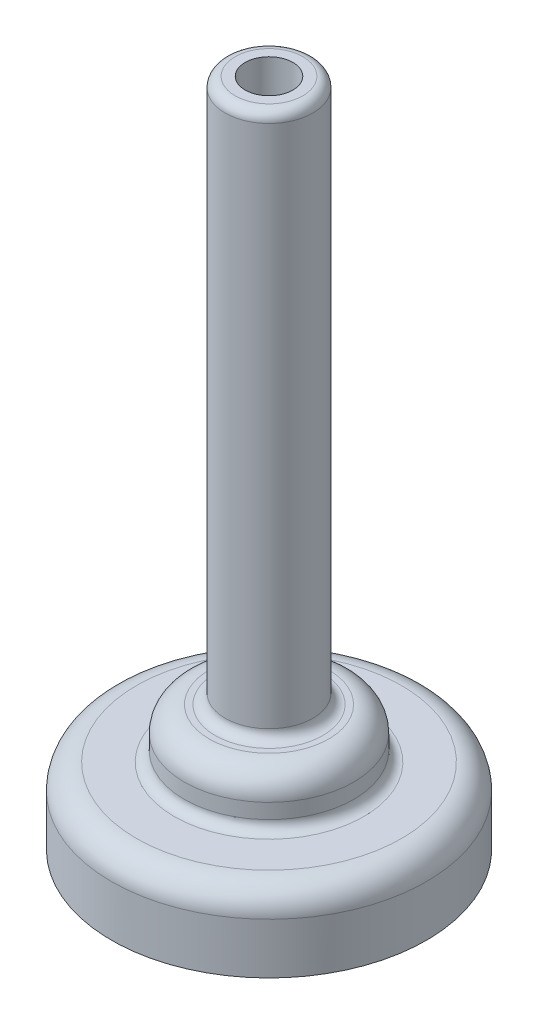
ISO-10303-21;
HEADER;
FILE_DESCRIPTION(('STEP AP214'),'2;1');
FILE_NAME('part.step','',(''),(''),'','','');
FILE_SCHEMA(('AUTOMOTIVE_DESIGN { 1 0 10303 214 1 1 1 1 }'));
ENDSEC;
DATA;
#1=APPLICATION_CONTEXT('core data for automotive mechanical design processes');
#2=APPLICATION_PROTOCOL_DEFINITION('international standard','automotive_design',2000,#1);
#3=PRODUCT_CONTEXT('',#1,'mechanical');
#4=PRODUCT('Part','Part','',(#3));
#5=PRODUCT_RELATED_PRODUCT_CATEGORY('part','',(#4));
#6=PRODUCT_DEFINITION_FORMATION('','',#4);
#7=PRODUCT_DEFINITION_CONTEXT('part definition',#1,'design');
#8=PRODUCT_DEFINITION('design','',#6,#7);
#9=PRODUCT_DEFINITION_SHAPE('','',#8);
#10=(LENGTH_UNIT() NAMED_UNIT(*) SI_UNIT(.MILLI.,.METRE.));
#11=(NAMED_UNIT(*) PLANE_ANGLE_UNIT() SI_UNIT($,.RADIAN.));
#12=(NAMED_UNIT(*) SI_UNIT($,.STERADIAN.) SOLID_ANGLE_UNIT());
#13=UNCERTAINTY_MEASURE_WITH_UNIT(LENGTH_MEASURE(1.E-05),#10,'distance_accuracy_value','');
#14=(GEOMETRIC_REPRESENTATION_CONTEXT(3) GLOBAL_UNCERTAINTY_ASSIGNED_CONTEXT((#13)) GLOBAL_UNIT_ASSIGNED_CONTEXT((#10,
#11,#12)) REPRESENTATION_CONTEXT('',''));
#15=CARTESIAN_POINT('',(0.,0.,0.));
#16=DIRECTION('',(0.,0.,1.));
#17=DIRECTION('',(1.,0.,0.));
#18=AXIS2_PLACEMENT_3D('',#15,#16,#17);
#19=CARTESIAN_POINT('',(-10.033,3.556,0.));
#20=DIRECTION('',(0.,1.,0.));
#21=DIRECTION('',(0.,0.,1.));
#22=AXIS2_PLACEMENT_3D('',#19,#20,#21);
#23=PLANE('',#22);
#24=CARTESIAN_POINT('',(0.,3.556,0.));
#25=DIRECTION('',(0.,1.,0.));
#26=DIRECTION('',(0.,0.,1.));
#27=AXIS2_PLACEMENT_3D('',#24,#25,#26);
#28=CIRCLE('',#27,4.7625);
#29=CARTESIAN_POINT('',(0.,3.556,4.7625));
#30=VERTEX_POINT('',#29);
#31=EDGE_CURVE('E42',#30,#30,#28,.T.);
#32=ORIENTED_EDGE('',*,*,#31,.T.);
#33=EDGE_LOOP('',(#32));
#34=FACE_BOUND('',#33,.T.);
#35=CARTESIAN_POINT('',(0.,3.556,0.));
#36=DIRECTION('',(0.,1.,0.));
#37=DIRECTION('',(0.,0.,1.));
#38=AXIS2_PLACEMENT_3D('',#35,#36,#37);
#39=CIRCLE('',#38,7.62);
#40=CARTESIAN_POINT('',(0.,3.556,7.62));
#41=VERTEX_POINT('',#40);
#42=EDGE_CURVE('E46',#41,#41,#39,.F.);
#43=ORIENTED_EDGE('',*,*,#42,.T.);
#44=EDGE_LOOP('',(#43));
#45=FACE_BOUND('',#44,.T.);
#46=ADVANCED_FACE('F31',(#34,#45),#23,.F.);
#47=CARTESIAN_POINT('',(-2.794,42.672,0.));
#48=DIRECTION('',(0.,1.,0.));
#49=DIRECTION('',(0.,0.,1.));
#50=AXIS2_PLACEMENT_3D('',#47,#48,#49);
#51=PLANE('',#50);
#52=CARTESIAN_POINT('',(0.,42.672,0.));
#53=DIRECTION('',(0.,1.,0.));
#54=DIRECTION('',(0.,0.,1.));
#55=AXIS2_PLACEMENT_3D('',#52,#53,#54);
#56=CIRCLE('',#55,2.159);
#57=CARTESIAN_POINT('',(0.,42.672,2.159));
#58=VERTEX_POINT('',#57);
#59=EDGE_CURVE('E10',#58,#58,#56,.T.);
#60=ORIENTED_EDGE('',*,*,#59,.T.);
#61=EDGE_LOOP('',(#60));
#62=FACE_BOUND('',#61,.T.);
#63=CARTESIAN_POINT('',(0.,42.672,0.));
#64=DIRECTION('',(0.,1.,0.));
#65=DIRECTION('',(0.,0.,1.));
#66=AXIS2_PLACEMENT_3D('',#63,#64,#65);
#67=CIRCLE('',#66,1.524);
#68=CARTESIAN_POINT('',(0.,42.672,1.524));
#69=VERTEX_POINT('',#68);
#70=EDGE_CURVE('E91',#69,#69,#67,.F.);
#71=ORIENTED_EDGE('',*,*,#70,.T.);
#72=EDGE_LOOP('',(#71));
#73=FACE_BOUND('',#72,.T.);
#74=ADVANCED_FACE('F123',(#62,#73),#51,.T.);
#75=CARTESIAN_POINT('',(0.,0.,0.));
#76=DIRECTION('',(0.,-1.,0.));
#77=DIRECTION('',(0.,0.,-1.));
#78=AXIS2_PLACEMENT_3D('',#75,#76,#77);
#79=CYLINDRICAL_SURFACE('',#78,2.794);
#80=CARTESIAN_POINT('',(0.,8.636,0.));
#81=DIRECTION('',(0.,1.,0.));
#82=DIRECTION('',(0.,0.,1.));
#83=AXIS2_PLACEMENT_3D('',#80,#81,#82);
#84=CIRCLE('',#83,2.794);
#85=CARTESIAN_POINT('',(0.,8.636,2.794));
#86=VERTEX_POINT('',#85);
#87=EDGE_CURVE('E66',#86,#86,#84,.T.);
#88=ORIENTED_EDGE('',*,*,#87,.T.);
#89=EDGE_LOOP('',(#88));
#90=FACE_BOUND('',#89,.T.);
#91=CARTESIAN_POINT('',(0.,42.037,0.));
#92=DIRECTION('',(0.,1.,0.));
#93=DIRECTION('',(0.,0.,1.));
#94=AXIS2_PLACEMENT_3D('',#91,#92,#93);
#95=CIRCLE('',#94,2.794);
#96=CARTESIAN_POINT('',(0.,42.037,2.794));
#97=VERTEX_POINT('',#96);
#98=EDGE_CURVE('E69',#97,#97,#95,.F.);
#99=ORIENTED_EDGE('',*,*,#98,.T.);
#100=EDGE_LOOP('',(#99));
#101=FACE_BOUND('',#100,.T.);
#102=ADVANCED_FACE('F129',(#90,#101),#79,.T.);
#103=CARTESIAN_POINT('',(-5.3975,8.001,0.));
#104=DIRECTION('',(0.,1.,0.));
#105=DIRECTION('',(0.,0.,1.));
#106=AXIS2_PLACEMENT_3D('',#103,#104,#105);
#107=PLANE('',#106);
#108=CARTESIAN_POINT('',(0.,8.001,0.));
#109=DIRECTION('',(0.,1.,0.));
#110=DIRECTION('',(0.,0.,1.));
#111=AXIS2_PLACEMENT_3D('',#108,#109,#110);
#112=CIRCLE('',#111,3.429);
#113=CARTESIAN_POINT('',(0.,8.001,3.429));
#114=VERTEX_POINT('',#113);
#115=EDGE_CURVE('E72',#114,#114,#112,.F.);
#116=ORIENTED_EDGE('',*,*,#115,.T.);
#117=EDGE_LOOP('',(#116));
#118=FACE_BOUND('',#117,.T.);
#119=CARTESIAN_POINT('',(0.,8.001,0.));
#120=DIRECTION('',(0.,1.,0.));
#121=DIRECTION('',(0.,0.,1.));
#122=AXIS2_PLACEMENT_3D('',#119,#120,#121);
#123=CIRCLE('',#122,3.81);
#124=CARTESIAN_POINT('',(0.,8.001,3.81));
#125=VERTEX_POINT('',#124);
#126=EDGE_CURVE('E75',#125,#125,#123,.T.);
#127=ORIENTED_EDGE('',*,*,#126,.T.);
#128=EDGE_LOOP('',(#127));
#129=FACE_BOUND('',#128,.T.);
#130=ADVANCED_FACE('F195',(#118,#129),#107,.T.);
#131=CARTESIAN_POINT('',(0.,0.,0.));
#132=DIRECTION('',(0.,-1.,0.));
#133=DIRECTION('',(0.,0.,-1.));
#134=AXIS2_PLACEMENT_3D('',#131,#132,#133);
#135=CYLINDRICAL_SURFACE('',#134,5.3975);
#136=CARTESIAN_POINT('',(0.,5.461,0.));
#137=DIRECTION('',(0.,1.,0.));
#138=DIRECTION('',(0.,0.,1.));
#139=AXIS2_PLACEMENT_3D('',#136,#137,#138);
#140=CIRCLE('',#139,5.3975);
#141=CARTESIAN_POINT('',(0.,5.461,5.3975));
#142=VERTEX_POINT('',#141);
#143=EDGE_CURVE('E60',#142,#142,#140,.T.);
#144=ORIENTED_EDGE('',*,*,#143,.T.);
#145=EDGE_LOOP('',(#144));
#146=FACE_BOUND('',#145,.T.);
#147=CARTESIAN_POINT('',(0.,6.4135,0.));
#148=DIRECTION('',(0.,1.,0.));
#149=DIRECTION('',(0.,0.,1.));
#150=AXIS2_PLACEMENT_3D('',#147,#148,#149);
#151=CIRCLE('',#150,5.3975);
#152=CARTESIAN_POINT('',(0.,6.4135,5.3975));
#153=VERTEX_POINT('',#152);
#154=EDGE_CURVE('E78',#153,#153,#151,.F.);
#155=ORIENTED_EDGE('',*,*,#154,.T.);
#156=EDGE_LOOP('',(#155));
#157=FACE_BOUND('',#156,.T.);
#158=ADVANCED_FACE('F201',(#146,#157),#135,.T.);
#159=CARTESIAN_POINT('',(-10.033,4.826,0.));
#160=DIRECTION('',(0.,1.,0.));
#161=DIRECTION('',(0.,0.,1.));
#162=AXIS2_PLACEMENT_3D('',#159,#160,#161);
#163=PLANE('',#162);
#164=CARTESIAN_POINT('',(0.,4.826,0.));
#165=DIRECTION('',(0.,1.,0.));
#166=DIRECTION('',(0.,0.,1.));
#167=AXIS2_PLACEMENT_3D('',#164,#165,#166);
#168=CIRCLE('',#167,6.0325);
#169=CARTESIAN_POINT('',(0.,4.826,6.0325));
#170=VERTEX_POINT('',#169);
#171=EDGE_CURVE('E63',#170,#170,#168,.F.);
#172=ORIENTED_EDGE('',*,*,#171,.T.);
#173=EDGE_LOOP('',(#172));
#174=FACE_BOUND('',#173,.T.);
#175=CARTESIAN_POINT('',(0.,4.826,0.));
#176=DIRECTION('',(0.,1.,0.));
#177=DIRECTION('',(0.,0.,1.));
#178=AXIS2_PLACEMENT_3D('',#175,#176,#177);
#179=CIRCLE('',#178,8.4455);
#180=CARTESIAN_POINT('',(0.,4.826,8.4455));
#181=VERTEX_POINT('',#180);
#182=EDGE_CURVE('E81',#181,#181,#179,.T.);
#183=ORIENTED_EDGE('',*,*,#182,.T.);
#184=EDGE_LOOP('',(#183));
#185=FACE_BOUND('',#184,.T.);
#186=ADVANCED_FACE('F118',(#174,#185),#163,.T.);
#187=CARTESIAN_POINT('',(0.,0.,0.));
#188=DIRECTION('',(0.,-1.,0.));
#189=DIRECTION('',(0.,0.,-1.));
#190=AXIS2_PLACEMENT_3D('',#187,#188,#189);
#191=CYLINDRICAL_SURFACE('',#190,10.033);
#192=CARTESIAN_POINT('',(0.,3.2385,0.));
#193=DIRECTION('',(0.,1.,0.));
#194=DIRECTION('',(0.,0.,1.));
#195=AXIS2_PLACEMENT_3D('',#192,#193,#194);
#196=CIRCLE('',#195,10.033);
#197=CARTESIAN_POINT('',(0.,3.2385,10.033));
#198=VERTEX_POINT('',#197);
#199=EDGE_CURVE('E84',#198,#198,#196,.F.);
#200=ORIENTED_EDGE('',*,*,#199,.T.);
#201=EDGE_LOOP('',(#200));
#202=FACE_BOUND('',#201,.T.);
#203=CARTESIAN_POINT('',(0.,0.,0.));
#204=DIRECTION('',(0.,-1.,0.));
#205=DIRECTION('',(0.,0.,-1.));
#206=AXIS2_PLACEMENT_3D('',#203,#204,#205);
#207=CIRCLE('',#206,10.033);
#208=CARTESIAN_POINT('',(0.,0.,-10.033));
#209=VERTEX_POINT('',#208);
#210=EDGE_CURVE('E87',#209,#209,#207,.T.);
#211=ORIENTED_EDGE('',*,*,#210,.F.);
#212=EDGE_LOOP('',(#211));
#213=FACE_BOUND('',#212,.T.);
#214=ADVANCED_FACE('F108',(#202,#213),#191,.T.);
#215=CARTESIAN_POINT('',(0.,0.,0.));
#216=DIRECTION('',(0.,-1.,0.));
#217=DIRECTION('',(0.,0.,-1.));
#218=AXIS2_PLACEMENT_3D('',#215,#216,#217);
#219=PLANE('',#218);
#220=ORIENTED_EDGE('',*,*,#210,.T.);
#221=EDGE_LOOP('',(#220));
#222=FACE_BOUND('',#221,.T.);
#223=CARTESIAN_POINT('',(0.,0.,0.));
#224=DIRECTION('',(0.,-1.,0.));
#225=DIRECTION('',(0.,0.,-1.));
#226=AXIS2_PLACEMENT_3D('',#223,#224,#225);
#227=CIRCLE('',#226,8.255);
#228=CARTESIAN_POINT('',(0.,0.,-8.255));
#229=VERTEX_POINT('',#228);
#230=EDGE_CURVE('E95',#229,#229,#227,.T.);
#231=ORIENTED_EDGE('',*,*,#230,.F.);
#232=EDGE_LOOP('',(#231));
#233=FACE_BOUND('',#232,.T.);
#234=ADVANCED_FACE('F105',(#222,#233),#219,.T.);
#235=CARTESIAN_POINT('',(0.,3.2385,0.));
#236=DIRECTION('',(0.,1.,0.));
#237=DIRECTION('',(0.,0.,1.));
#238=AXIS2_PLACEMENT_3D('',#235,#236,#237);
#239=TOROIDAL_SURFACE('',#238,8.4455,1.5875);
#240=ORIENTED_EDGE('',*,*,#182,.F.);
#241=EDGE_LOOP('',(#240));
#242=FACE_BOUND('',#241,.T.);
#243=ORIENTED_EDGE('',*,*,#199,.F.);
#244=EDGE_LOOP('',(#243));
#245=FACE_BOUND('',#244,.T.);
#246=ADVANCED_FACE('F107',(#242,#245),#239,.T.);
#247=CARTESIAN_POINT('',(0.,6.4135,0.));
#248=DIRECTION('',(0.,1.,0.));
#249=DIRECTION('',(0.,0.,1.));
#250=AXIS2_PLACEMENT_3D('',#247,#248,#249);
#251=TOROIDAL_SURFACE('',#250,3.81,1.5875);
#252=ORIENTED_EDGE('',*,*,#126,.F.);
#253=EDGE_LOOP('',(#252));
#254=FACE_BOUND('',#253,.T.);
#255=ORIENTED_EDGE('',*,*,#154,.F.);
#256=EDGE_LOOP('',(#255));
#257=FACE_BOUND('',#256,.T.);
#258=ADVANCED_FACE('F115',(#254,#257),#251,.T.);
#259=CARTESIAN_POINT('',(0.,0.,0.));
#260=DIRECTION('',(0.,-1.,0.));
#261=DIRECTION('',(0.,0.,-1.));
#262=AXIS2_PLACEMENT_3D('',#259,#260,#261);
#263=CYLINDRICAL_SURFACE('',#262,1.524);
#264=CARTESIAN_POINT('',(0.,7.366,0.));
#265=DIRECTION('',(0.,1.,0.));
#266=DIRECTION('',(0.,0.,1.));
#267=AXIS2_PLACEMENT_3D('',#264,#265,#266);
#268=CIRCLE('',#267,1.524);
#269=CARTESIAN_POINT('',(0.,7.366,1.524));
#270=VERTEX_POINT('',#269);
#271=EDGE_CURVE('E57',#270,#270,#268,.F.);
#272=ORIENTED_EDGE('',*,*,#271,.T.);
#273=EDGE_LOOP('',(#272));
#274=FACE_BOUND('',#273,.T.);
#275=ORIENTED_EDGE('',*,*,#70,.F.);
#276=EDGE_LOOP('',(#275));
#277=FACE_BOUND('',#276,.T.);
#278=ADVANCED_FACE('F152',(#274,#277),#263,.F.);
#279=CARTESIAN_POINT('',(-5.3975,6.731,0.));
#280=DIRECTION('',(0.,1.,0.));
#281=DIRECTION('',(0.,0.,1.));
#282=AXIS2_PLACEMENT_3D('',#279,#280,#281);
#283=PLANE('',#282);
#284=CARTESIAN_POINT('',(0.,6.731,0.));
#285=DIRECTION('',(0.,1.,0.));
#286=DIRECTION('',(0.,0.,1.));
#287=AXIS2_PLACEMENT_3D('',#284,#285,#286);
#288=CIRCLE('',#287,2.159);
#289=CARTESIAN_POINT('',(0.,6.731,2.159));
#290=VERTEX_POINT('',#289);
#291=EDGE_CURVE('E54',#290,#290,#288,.T.);
#292=ORIENTED_EDGE('',*,*,#291,.T.);
#293=EDGE_LOOP('',(#292));
#294=FACE_BOUND('',#293,.T.);
#295=CARTESIAN_POINT('',(0.,6.731,0.));
#296=DIRECTION('',(0.,1.,0.));
#297=DIRECTION('',(0.,0.,1.));
#298=AXIS2_PLACEMENT_3D('',#295,#296,#297);
#299=CIRCLE('',#298,3.81);
#300=CARTESIAN_POINT('',(0.,6.731,3.81));
#301=VERTEX_POINT('',#300);
#302=EDGE_CURVE('E90',#301,#301,#299,.T.);
#303=ORIENTED_EDGE('',*,*,#302,.F.);
#304=EDGE_LOOP('',(#303));
#305=FACE_BOUND('',#304,.T.);
#306=ADVANCED_FACE('F144',(#294,#305),#283,.F.);
#307=CARTESIAN_POINT('',(0.,0.,0.));
#308=DIRECTION('',(0.,-1.,0.));
#309=DIRECTION('',(0.,0.,-1.));
#310=AXIS2_PLACEMENT_3D('',#307,#308,#309);
#311=CYLINDRICAL_SURFACE('',#310,4.1275);
#312=CARTESIAN_POINT('',(0.,4.191,0.));
#313=DIRECTION('',(0.,1.,0.));
#314=DIRECTION('',(0.,0.,1.));
#315=AXIS2_PLACEMENT_3D('',#312,#313,#314);
#316=CIRCLE('',#315,4.1275);
#317=CARTESIAN_POINT('',(0.,4.191,4.1275));
#318=VERTEX_POINT('',#317);
#319=EDGE_CURVE('E51',#318,#318,#316,.F.);
#320=ORIENTED_EDGE('',*,*,#319,.T.);
#321=EDGE_LOOP('',(#320));
#322=FACE_BOUND('',#321,.T.);
#323=CARTESIAN_POINT('',(0.,6.4135,0.));
#324=DIRECTION('',(0.,-1.,0.));
#325=DIRECTION('',(0.,0.,-1.));
#326=AXIS2_PLACEMENT_3D('',#323,#324,#325);
#327=CIRCLE('',#326,4.1275);
#328=CARTESIAN_POINT('',(0.,6.4135,-4.1275));
#329=VERTEX_POINT('',#328);
#330=EDGE_CURVE('E94',#329,#329,#327,.T.);
#331=ORIENTED_EDGE('',*,*,#330,.F.);
#332=EDGE_LOOP('',(#331));
#333=FACE_BOUND('',#332,.T.);
#334=ADVANCED_FACE('F133',(#322,#333),#311,.F.);
#335=CARTESIAN_POINT('',(0.,6.4135,0.));
#336=DIRECTION('',(0.,1.,0.));
#337=DIRECTION('',(0.,0.,1.));
#338=AXIS2_PLACEMENT_3D('',#335,#336,#337);
#339=TOROIDAL_SURFACE('',#338,3.81,0.3175);
#340=ORIENTED_EDGE('',*,*,#302,.T.);
#341=EDGE_LOOP('',(#340));
#342=FACE_BOUND('',#341,.T.);
#343=ORIENTED_EDGE('',*,*,#330,.T.);
#344=EDGE_LOOP('',(#343));
#345=FACE_BOUND('',#344,.T.);
#346=ADVANCED_FACE('F135',(#342,#345),#339,.F.);
#347=CARTESIAN_POINT('',(0.,28.3415068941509,0.));
#348=DIRECTION('',(0.,-1.,0.));
#349=DIRECTION('',(0.,0.,-1.));
#350=AXIS2_PLACEMENT_3D('',#347,#348,#349);
#351=CYLINDRICAL_SURFACE('',#350,8.255);
#352=CARTESIAN_POINT('',(0.,2.921,0.));
#353=DIRECTION('',(0.,1.,0.));
#354=DIRECTION('',(0.,0.,1.));
#355=AXIS2_PLACEMENT_3D('',#352,#353,#354);
#356=CIRCLE('',#355,8.255);
#357=CARTESIAN_POINT('',(0.,2.921,8.255));
#358=VERTEX_POINT('',#357);
#359=EDGE_CURVE('E38',#358,#358,#356,.T.);
#360=ORIENTED_EDGE('',*,*,#359,.T.);
#361=EDGE_LOOP('',(#360));
#362=FACE_BOUND('',#361,.T.);
#363=ORIENTED_EDGE('',*,*,#230,.T.);
#364=EDGE_LOOP('',(#363));
#365=FACE_BOUND('',#364,.T.);
#366=ADVANCED_FACE('F103',(#362,#365),#351,.F.);
#367=CARTESIAN_POINT('',(0.,8.636,0.));
#368=DIRECTION('',(0.,1.,0.));
#369=DIRECTION('',(0.,0.,1.));
#370=AXIS2_PLACEMENT_3D('',#367,#368,#369);
#371=TOROIDAL_SURFACE('',#370,3.429,0.635);
#372=ORIENTED_EDGE('',*,*,#87,.F.);
#373=EDGE_LOOP('',(#372));
#374=FACE_BOUND('',#373,.T.);
#375=ORIENTED_EDGE('',*,*,#115,.F.);
#376=EDGE_LOOP('',(#375));
#377=FACE_BOUND('',#376,.T.);
#378=ADVANCED_FACE('F142',(#374,#377),#371,.F.);
#379=CARTESIAN_POINT('',(0.,5.461,0.));
#380=DIRECTION('',(0.,1.,0.));
#381=DIRECTION('',(0.,0.,1.));
#382=AXIS2_PLACEMENT_3D('',#379,#380,#381);
#383=TOROIDAL_SURFACE('',#382,6.0325,0.635);
#384=ORIENTED_EDGE('',*,*,#143,.F.);
#385=EDGE_LOOP('',(#384));
#386=FACE_BOUND('',#385,.T.);
#387=ORIENTED_EDGE('',*,*,#171,.F.);
#388=EDGE_LOOP('',(#387));
#389=FACE_BOUND('',#388,.T.);
#390=ADVANCED_FACE('F165',(#386,#389),#383,.F.);
#391=CARTESIAN_POINT('',(0.,7.366,0.));
#392=DIRECTION('',(0.,1.,0.));
#393=DIRECTION('',(0.,0.,1.));
#394=AXIS2_PLACEMENT_3D('',#391,#392,#393);
#395=TOROIDAL_SURFACE('',#394,2.159,0.635);
#396=ORIENTED_EDGE('',*,*,#291,.F.);
#397=EDGE_LOOP('',(#396));
#398=FACE_BOUND('',#397,.T.);
#399=ORIENTED_EDGE('',*,*,#271,.F.);
#400=EDGE_LOOP('',(#399));
#401=FACE_BOUND('',#400,.T.);
#402=ADVANCED_FACE('F161',(#398,#401),#395,.T.);
#403=CARTESIAN_POINT('',(0.,4.191,0.));
#404=DIRECTION('',(0.,1.,0.));
#405=DIRECTION('',(0.,0.,1.));
#406=AXIS2_PLACEMENT_3D('',#403,#404,#405);
#407=TOROIDAL_SURFACE('',#406,4.7625,0.635);
#408=ORIENTED_EDGE('',*,*,#31,.F.);
#409=EDGE_LOOP('',(#408));
#410=FACE_BOUND('',#409,.T.);
#411=ORIENTED_EDGE('',*,*,#319,.F.);
#412=EDGE_LOOP('',(#411));
#413=FACE_BOUND('',#412,.T.);
#414=ADVANCED_FACE('F164',(#410,#413),#407,.T.);
#415=CARTESIAN_POINT('',(0.,2.921,0.));
#416=DIRECTION('',(0.,1.,0.));
#417=DIRECTION('',(0.,0.,1.));
#418=AXIS2_PLACEMENT_3D('',#415,#416,#417);
#419=TOROIDAL_SURFACE('',#418,7.62,0.635);
#420=ORIENTED_EDGE('',*,*,#42,.F.);
#421=EDGE_LOOP('',(#420));
#422=FACE_BOUND('',#421,.T.);
#423=ORIENTED_EDGE('',*,*,#359,.F.);
#424=EDGE_LOOP('',(#423));
#425=FACE_BOUND('',#424,.T.);
#426=ADVANCED_FACE('F175',(#422,#425),#419,.F.);
#427=CARTESIAN_POINT('',(0.,42.037,0.));
#428=DIRECTION('',(0.,1.,0.));
#429=DIRECTION('',(0.,0.,1.));
#430=AXIS2_PLACEMENT_3D('',#427,#428,#429);
#431=TOROIDAL_SURFACE('',#430,2.159,0.635);
#432=ORIENTED_EDGE('',*,*,#59,.F.);
#433=EDGE_LOOP('',(#432));
#434=FACE_BOUND('',#433,.T.);
#435=ORIENTED_EDGE('',*,*,#98,.F.);
#436=EDGE_LOOP('',(#435));
#437=FACE_BOUND('',#436,.T.);
#438=ADVANCED_FACE('F33',(#434,#437),#431,.T.);
#439=CLOSED_SHELL('',(#46,#74,#102,#130,#158,#186,#214,#234,#246,#258,#278,#306,#334,#346,#366,
#378,#390,#402,#414,#426,#438));
#440=MANIFOLD_SOLID_BREP('B2',#439);
#441=ADVANCED_BREP_SHAPE_REPRESENTATION('',(#18,#440),#14);
#442=SHAPE_DEFINITION_REPRESENTATION(#9,#441);
ENDSEC;
END-ISO-10303-21;
